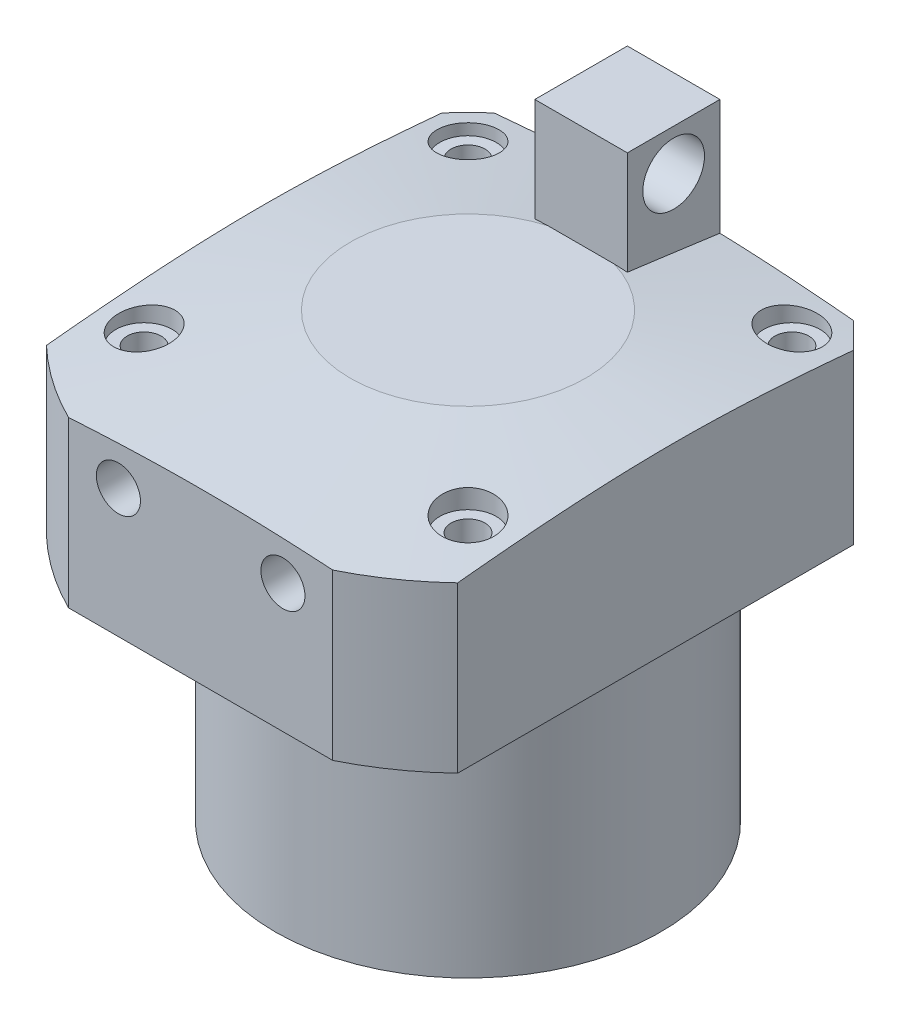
from build123d import *

# Parameters (mm, degrees)
SKETCH2_OUTSIDE_W                            = 155.044
SKETCH2_OUTSIDE_H                            = 155.044
SKETCH2_OUTSIDE_W_2                          = 80
SKETCH2_OUTSIDE_H_2                          = 92
CUT_EXTRUDE2_DEPTH                           = 119.844436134
CHAMFER1_SIZE                                = 5
G1_8_TAPPED_HOLE1_D                          = 8.566
G1_8_TAPPED_HOLE1_DEPTH                      = 22.18
CBORE_FOR_M6_HEX_SOCKET_HEAD_CAP_SCR_2_COUNT = 2
CBORE_FOR_M6_HEX_SOCKET_HEAD_CAP_SCR_2_PITCH = 63
CBORE_FOR_M6_HEX_SOCKET_HEAD_CAP_SCR_3_COUNT = 2
CBORE_FOR_M6_HEX_SOCKET_HEAD_CAP_SCR_3_PITCH = 89.09545443
CBORE_FOR_M6_HEX_SOCKET_HEAD_CAP_SCR_4_COUNT = 2
CBORE_FOR_M6_HEX_SOCKET_HEAD_CAP_SCR_4_PITCH = 63
F_8_0_8_DIAMETER_HOLE2_D                     = 8
F_8_0_8_DIAMETER_HOLE2_DEPTH                 = 1.5
SKETCH13_W                                   = 18
SKETCH13_H                                   = 18
BOSS_EXTRUDE1_DEPTH                          = 20
BOSS_EXTRUDE1_DIRECTION_2_REACH              = 110.167
SKETCH14_R                                   = 6
CUT_EXTRUDE3_DEPTH                           = 20


with BuildPart() as part:
    # Sketch1 → Revolve1 (revolve)
    with BuildSketch(Plane.XY, mode=Mode.PRIVATE) as revolve1_sk:
        Polygon((0, 0), (-37.5, 0), (-37.5, 49), (-58, 49), (-58, 81.069560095), (-22.918097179, 86), (0, 86), align=None)
    revolve(revolve1_sk.sketch.rotate(Axis((0, 87.050829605, 0), (0, -1, 0)), 270), axis=Axis((0, 87.050829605, 0), (0, -1, 0)))

    # Sketch2 outside → Cut-Extrude2 (cut, through all)
    with BuildSketch(Plane(origin=(0, 86, 0), x_dir=(1, 0, 0), z_dir=(0, 1, 0))):
        Rectangle(SKETCH2_OUTSIDE_W, SKETCH2_OUTSIDE_H)
        with Locations((0, -6)):
            Rectangle(SKETCH2_OUTSIDE_W_2, SKETCH2_OUTSIDE_H_2, mode=Mode.SUBTRACT)
    extrude(amount=-CUT_EXTRUDE2_DEPTH, mode=Mode.SUBTRACT)

    # Chamfer1
    chamfer1_edges = [part.edges().sort_by_distance(p)[0] for p in [
        (40, 65.135369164, -40),
        (-40, 65.135369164, -40),
    ]]
    chamfer(chamfer1_edges, length=CHAMFER1_SIZE)

    # G1_8 Tapped Hole1
    with Locations(Plane.XY.offset(52)):
        with Locations((-16, 74), (16, 74)):
            Hole(G1_8_TAPPED_HOLE1_D / 2, depth=G1_8_TAPPED_HOLE1_DEPTH)

    # Sketch9 → CBORE for M6 Hex Socket Head Cap Screw2 (revolve, cut)
    with BuildSketch(Plane(origin=(-31.5, 86, -31.5), x_dir=(0, 0, 1), z_dir=(1, 0, 0))):
        Polygon((0, 0), (0, 37), (3.325, 37), (3.3, 36.975), (3.3, 6), (5.5, 6), (5.5, 0), align=None)
    cbore_for_m6_hex_socket_head_cap_screw2 = revolve(axis=Axis((-31.5, 92.35, -31.5), (0, -1, 0)), mode=Mode.SUBTRACT)

    # CBORE for M6 Hex Socket Head Cap Scr 2: CBORE for M6 Hex Socket Head Cap Screw2 ×2
    with Locations(*[(i * CBORE_FOR_M6_HEX_SOCKET_HEAD_CAP_SCR_2_PITCH, 0, 0) for i in range(1, CBORE_FOR_M6_HEX_SOCKET_HEAD_CAP_SCR_2_COUNT)]):
        add(cbore_for_m6_hex_socket_head_cap_screw2, mode=Mode.SUBTRACT)

    # CBORE for M6 Hex Socket Head Cap Scr 3: CBORE for M6 Hex Socket Head Cap Screw2 ×2
    with Locations(*[Vector(0.7071067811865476, 0, 0.7071067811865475) * (i * CBORE_FOR_M6_HEX_SOCKET_HEAD_CAP_SCR_3_PITCH) for i in range(1, CBORE_FOR_M6_HEX_SOCKET_HEAD_CAP_SCR_3_COUNT)]):
        add(cbore_for_m6_hex_socket_head_cap_screw2, mode=Mode.SUBTRACT)

    # CBORE for M6 Hex Socket Head Cap Scr 4: CBORE for M6 Hex Socket Head Cap Screw2 ×2
    with Locations(*[(0, 0, i * CBORE_FOR_M6_HEX_SOCKET_HEAD_CAP_SCR_4_PITCH) for i in range(1, CBORE_FOR_M6_HEX_SOCKET_HEAD_CAP_SCR_4_COUNT)]):
        add(cbore_for_m6_hex_socket_head_cap_screw2, mode=Mode.SUBTRACT)

    # 8.0 _8_ Diameter Hole2
    with Locations(Plane.XZ.offset(-49)):
        with Locations((-16, 45), (16, 45)):
            Hole(F_8_0_8_DIAMETER_HOLE2_D / 2, depth=F_8_0_8_DIAMETER_HOLE2_DEPTH)

    # Sketch13 → Boss-Extrude1 (add)
    with BuildSketch(Plane(origin=(0, 86, 0), x_dir=(-1, 0, 0), z_dir=(0, 1, 0))):
        with Locations((0, -31)):
            Rectangle(SKETCH13_W, SKETCH13_H)
    extrude(amount=BOSS_EXTRUDE1_DEPTH)

    # Boss-Extrude1 direction 2: up to this cone (the profile starts outside it)
    boss_extrude1_direction_2_end = Plane(origin=(0, 86, 0), z_dir=(0, -1, 0)).offset(-3.220927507) * Cone(7.115e-06, 973.425453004, 136.806024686, align=(Align.CENTER, Align.CENTER, Align.MIN), mode=Mode.PRIVATE)
    # Sketch13 → Boss-Extrude1 direction 2 (add, up to the surface)
    with BuildSketch(Plane(origin=(0, 86, 0), x_dir=(-1, 0, 0), z_dir=(0, 1, 0)), mode=Mode.PRIVATE) as boss_extrude1_direction_2_sk1:
        with Locations((0, -31)):
            Rectangle(SKETCH13_W, SKETCH13_H)
    boss_extrude1_direction_2_tool1 = extrude(boss_extrude1_direction_2_sk1.sketch, amount=-BOSS_EXTRUDE1_DIRECTION_2_REACH, mode=Mode.PRIVATE) - boss_extrude1_direction_2_end
    add(boss_extrude1_direction_2_tool1.solids().sort_by_distance((0, 86, -31))[0])

    # Sketch14 → Cut-Extrude3 (cut)
    with BuildSketch(Plane.ZY.offset(9)):
        with Locations((-31, 98)):
            Circle(SKETCH14_R)
    extrude(amount=-CUT_EXTRUDE3_DEPTH, mode=Mode.SUBTRACT)


solid = part.part
